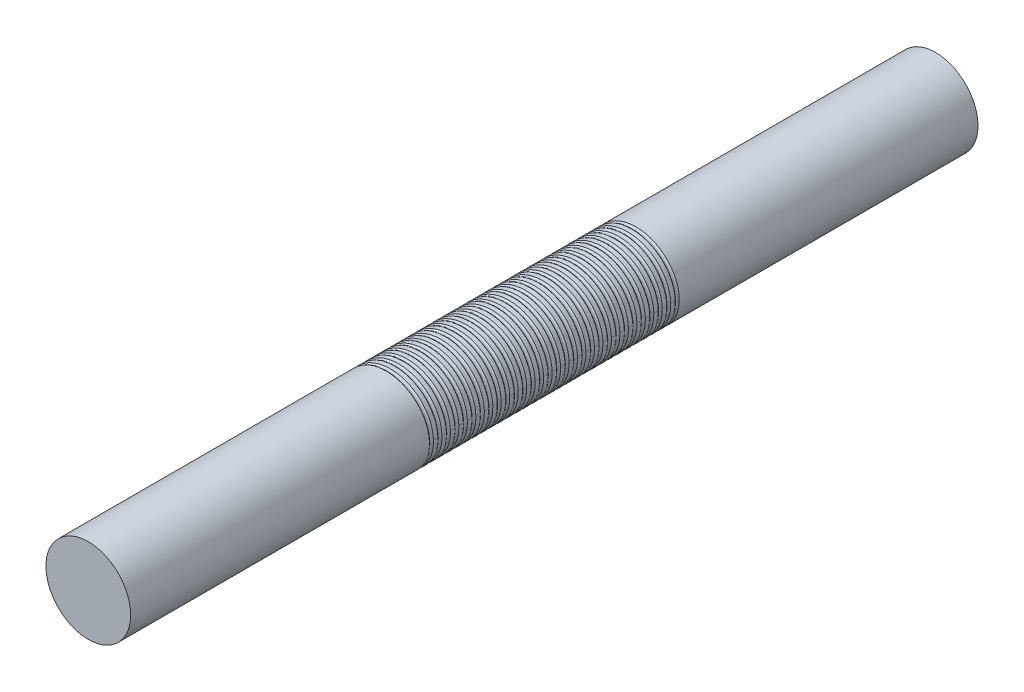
from build123d import *

# Parameters (mm, degrees)
SKETCH1_R              = 25
BOSS_EXTRUDE1_DEPTH    = 500
CUT_SWEEP1_PITCH       = 5
CUT_SWEEP1_HEIGHT      = 150
CUT_SWEEP1_RADIUS      = 26.06
CUT_SWEEP1_START_ANGLE = -180
SKETCH3_R              = 1.59


with BuildPart() as part:
    # Sketch1 → Boss-Extrude1 (new body)
    with BuildSketch(Plane.XY):
        Circle(SKETCH1_R)
    extrude(amount=BOSS_EXTRUDE1_DEPTH)

    # Cut-Sweep1: sweep along a helix
    with BuildLine() as cut_sweep1_path:
        add(Helix(CUT_SWEEP1_PITCH, CUT_SWEEP1_HEIGHT, CUT_SWEEP1_RADIUS, center=(0, 0, 175), direction=(0, 0, 1), mode=Mode.PRIVATE).rotate(Axis((0, 0, 175), (0, 0, 1)), CUT_SWEEP1_START_ANGLE))
    # Sketch3 → Cut-Sweep1 (sweep, cut)
    with BuildSketch(Plane(origin=(0, 0, 0), x_dir=(1, 0, 0), z_dir=(0, 1, 0))):
        with Locations((-26.06, -175)):
            Circle(SKETCH3_R)
    sweep(path=cut_sweep1_path.line, is_frenet=True, mode=Mode.SUBTRACT)


solid = part.part
